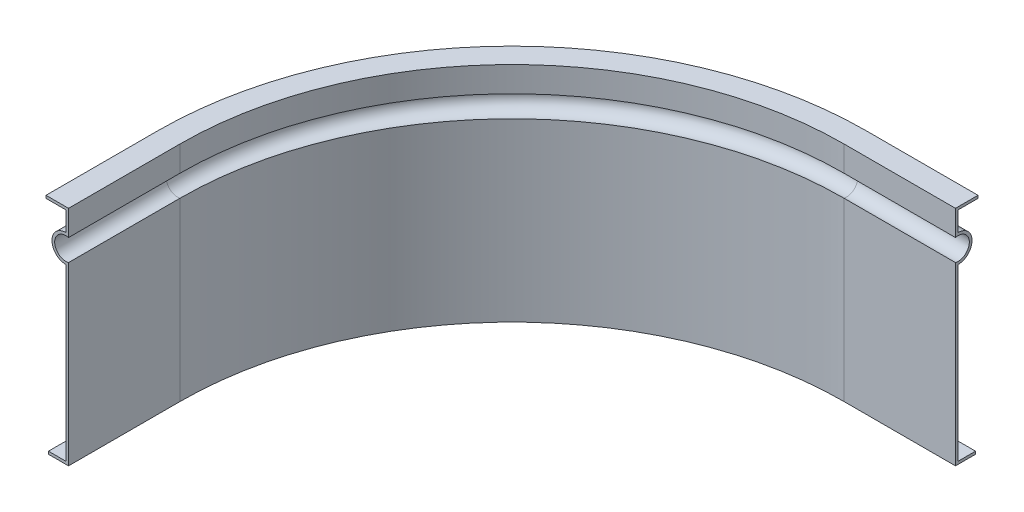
from build123d import *


with BuildPart() as part:
    # Sweep1: sweep along a path in Sketch1
    with BuildLine(Plane(origin=(0, 0, 0), x_dir=(1, 0, 0), z_dir=(0, 1, 0))) as sweep1_path:
        Line((0, 0), (0, 50))
        ThreePointArc((0, 50), (43.222838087, 154.349161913), (147.572, 197.572))
        Line((147.572, 197.572), (197.572, 197.572))
    # Sketch2 → Sweep1 (sweep)
    with BuildSketch(Plane.XY):
        with BuildLine():
            Line((-10.214, -1.214), (-1.214, -1.214))
            Line((-1.214, -1.214), (-1.214, 77.721618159))
            ThreePointArc((-1.214, 77.721618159), (-7.428, 82.572), (-1.214, 87.422381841))
            Line((-1.214, 87.422381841), (-1.214, 98.786))
            Line((-1.214, 98.786), (-11.318059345, 98.786))
            Line((-11.318059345, 98.786), (-11.318059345, 97.572))
            Line((-11.318059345, 97.572), (-2.428, 97.572))
            Line((-2.428, 97.572), (-2.428, 88.786))
            ThreePointArc((-2.428, 88.786), (-8.642, 82.572), (-2.428, 76.358))
            Line((-2.428, 76.358), (-2.428, 0))
            Line((-2.428, 0), (-10.214, 0))
            Line((-10.214, 0), (-10.214, -1.214))
        make_face()
    sweep(path=sweep1_path.line)


solid = part.part
